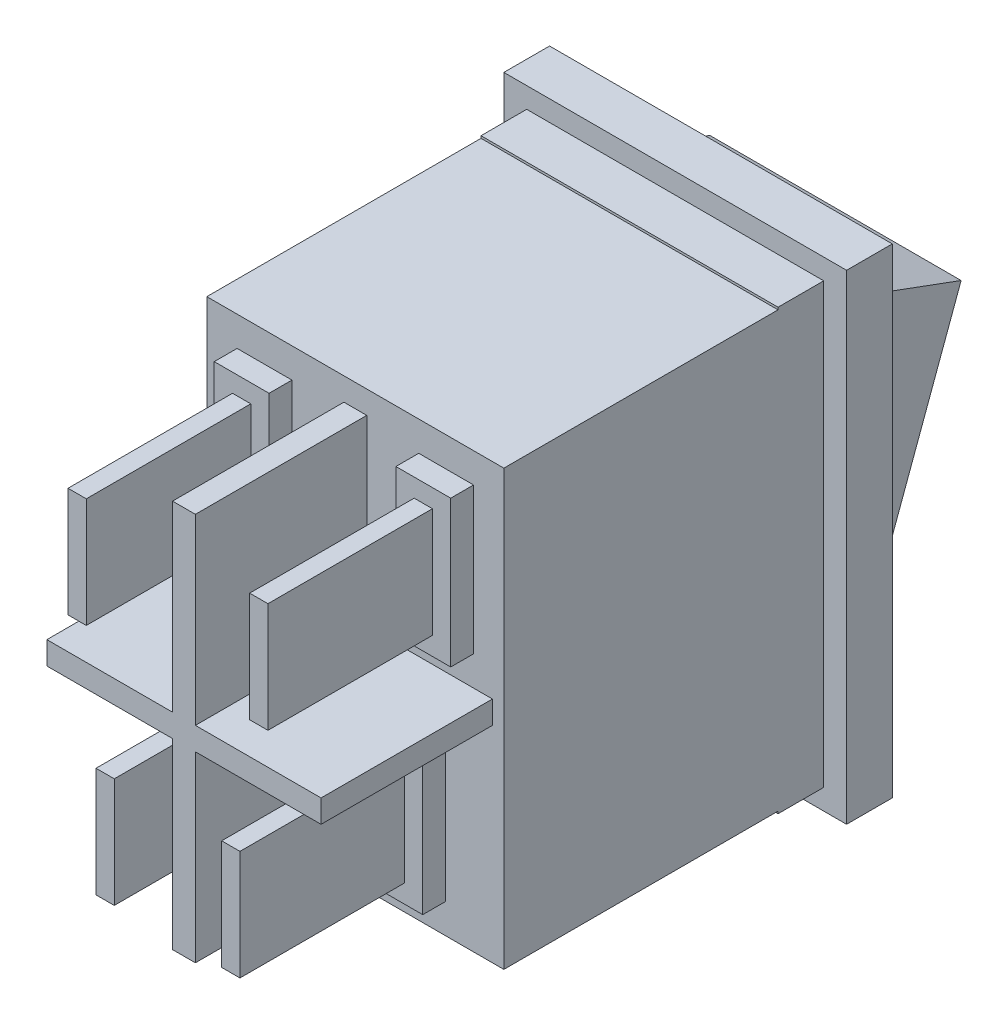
from build123d import *

# Parameters (mm, degrees)
SKETCH_1_W               = 13
SKETCH_1_H               = 19
EXTRUDE_1_DEPTH          = 14
SKETCH_2_W               = 15
SKETCH_2_H               = 21
EXTRUDE_2_DEPTH          = 2
SKETCH_3_W               = 11
SKETCH_3_H               = 16
CUT_EXTRUDE_1_DEPTH      = 13
BOSS_EXTRUDE1_DEPTH      = 5.5
BOSS_EXTRUDE1_DEPTH_BACK = 5.5
BOSS_EXTRUDE2_DEPTH      = 7.5
SKETCH3_W                = 0.8
SKETCH3_H                = 4.8
BOSS_EXTRUDE3_DEPTH      = 8.2
BOSS_EXTRUDE3_2_DEPTH    = 8.2
BOSS_EXTRUDE3_3_DEPTH    = 8.2
BOSS_EXTRUDE3_4_DEPTH    = 8.2
SKETCH4_W                = 2.4
SKETCH4_H                = 6.4
BOSS_EXTRUDE4_DEPTH      = 1
SKETCH5_W                = 13
SKETCH5_H                = 0.1
BOSS_EXTRUDE5_DEPTH      = 2


with BuildPart() as part:
    # Sketch 1 → Extrude 1 (new body)
    with BuildSketch(Plane.XY):
        Rectangle(SKETCH_1_W, SKETCH_1_H)
    extrude(amount=EXTRUDE_1_DEPTH)

    # Sketch 2 → Extrude 2 (add)
    with BuildSketch(Plane(origin=(0, 0, 0), x_dir=(-1, 0, 0), z_dir=(0, 0, -1))):
        Rectangle(SKETCH_2_W, SKETCH_2_H)
    extrude(amount=EXTRUDE_2_DEPTH)

    # Sketch 3 → Cut-Extrude 1 (cut)
    with BuildSketch(Plane(origin=(0, 0, -2), x_dir=(-1, 0, 0), z_dir=(0, 0, -1))):
        Rectangle(SKETCH_3_W, SKETCH_3_H)
    extrude(amount=-CUT_EXTRUDE_1_DEPTH, mode=Mode.SUBTRACT)

    # Sketch2 → Boss-Extrude2 (add)
    with BuildSketch(Plane.XY.offset(14)):
        Polygon((-6, 0.5), (-0.5, 0.5), (-0.5, 8.5), (0.5, 8.5), (0.5, 0.5), (6, 0.5), (6, -0.5), (0.5, -0.5), (0.5, -8.5), (-0.5, -8.5), (-0.5, -0.5), (-6, -0.5), align=None)
    extrude(amount=BOSS_EXTRUDE2_DEPTH)



with BuildPart() as body_2:
    # 3DSketch1 → Boss-Extrude1 (new, two sides: drawn at the far end of the back side and taken through both)
    with BuildSketch(Plane(origin=(0, -8, -2), x_dir=(0, 0.9883662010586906, 0.15209290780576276), z_dir=(-1, 0, 0)).offset(-BOSS_EXTRUDE1_DEPTH_BACK)):
        Polygon((0, 0), (12.685213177, 7.023913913), (16.574415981, 0), (3.889202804, -7.023913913), align=None)
    extrude(amount=BOSS_EXTRUDE1_DEPTH + BOSS_EXTRUDE1_DEPTH_BACK)


with BuildPart() as body_3:
    # Sketch3 → Boss-Extrude3 (new body)
    with BuildSketch(Plane.XY.offset(14)):
        with Locations((-3.975, 5)):
            Rectangle(SKETCH3_W, SKETCH3_H)
    extrude(amount=BOSS_EXTRUDE3_DEPTH)


with BuildPart() as body_4:
    # Sketch3 → Boss-Extrude3 2 (new body)
    with BuildSketch(Plane.XY.offset(14)):
        with Locations((3.975, 5)):
            Rectangle(SKETCH3_W, SKETCH3_H)
    extrude(amount=BOSS_EXTRUDE3_2_DEPTH)


with BuildPart() as body_5:
    # Sketch3 → Boss-Extrude3 3 (new body)
    with BuildSketch(Plane.XY.offset(14)):
        with Locations((-2.75, -5)):
            Rectangle(SKETCH3_W, SKETCH3_H)
    extrude(amount=BOSS_EXTRUDE3_3_DEPTH)


with BuildPart() as body_6:
    # Sketch3 → Boss-Extrude3 4 (new body)
    with BuildSketch(Plane.XY.offset(14)):
        with Locations((2.75, -5)):
            Rectangle(SKETCH3_W, SKETCH3_H)
    extrude(amount=BOSS_EXTRUDE3_4_DEPTH)


with BuildPart() as part_1:
    add(part.part)

    add(body_3.part)  # Boss-Extrude4 merges body 3

    add(body_4.part)  # Boss-Extrude4 merges body 4

    add(body_5.part)  # Boss-Extrude4 merges body 5

    add(body_6.part)  # Boss-Extrude4 merges body 6
    # Sketch4 → Boss-Extrude4 (add)
    with BuildSketch(Plane.XY.offset(14)):
        with Locations((-3.975, 5)):
            Rectangle(SKETCH4_W, SKETCH4_H)
        with Locations((3.975, 5)):
            Rectangle(SKETCH4_W, SKETCH4_H)
        with Locations((-2.75, -5)):
            Rectangle(SKETCH4_W, SKETCH4_H)
        with Locations((2.75, -5)):
            Rectangle(SKETCH4_W, SKETCH4_H)
    extrude(amount=BOSS_EXTRUDE4_DEPTH)

    # Sketch5 → Boss-Extrude5 (add)
    with BuildSketch(Plane.XY):
        with Locations((0, 9.55)):
            Rectangle(SKETCH5_W, SKETCH5_H)
        with Locations((0, -9.55)):
            Rectangle(SKETCH5_W, SKETCH5_H)
    extrude(amount=BOSS_EXTRUDE5_DEPTH)


solid = Compound([body_2.part, part_1.part])
